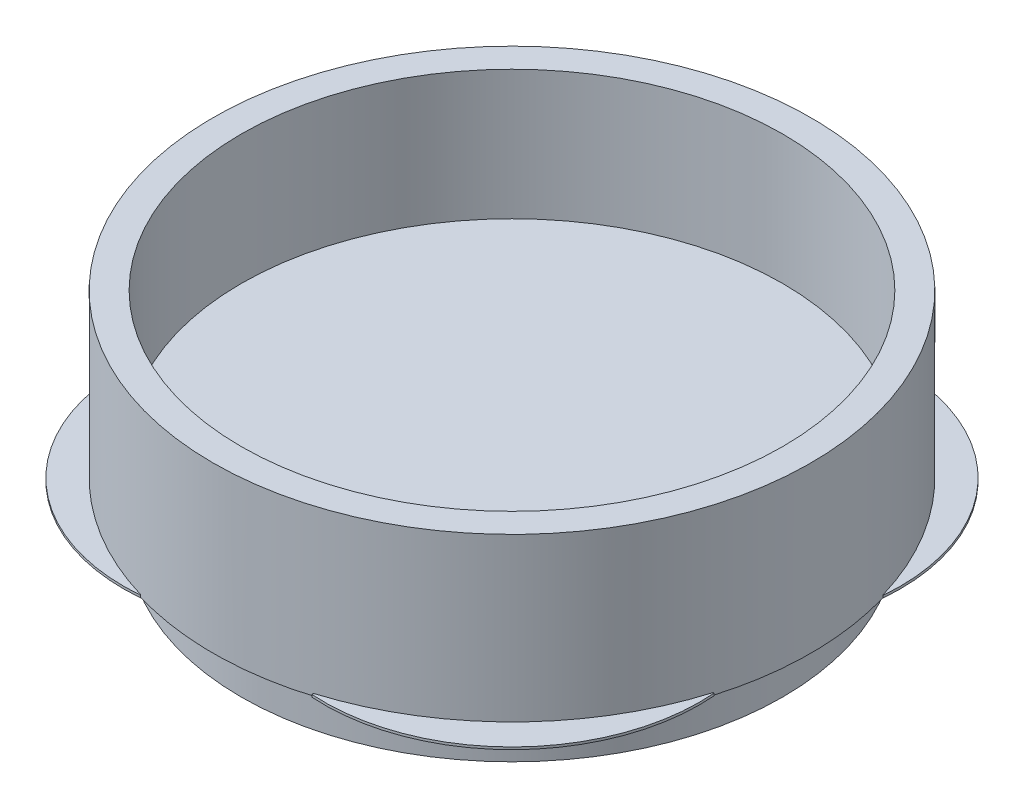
ISO-10303-21;
HEADER;
FILE_DESCRIPTION(('STEP AP214'),'2;1');
FILE_NAME('part.step','',(''),(''),'','','');
FILE_SCHEMA(('AUTOMOTIVE_DESIGN { 1 0 10303 214 1 1 1 1 }'));
ENDSEC;
DATA;
#1=APPLICATION_CONTEXT('core data for automotive mechanical design processes');
#2=APPLICATION_PROTOCOL_DEFINITION('international standard','automotive_design',2000,#1);
#3=PRODUCT_CONTEXT('',#1,'mechanical');
#4=PRODUCT('Part','Part','',(#3));
#5=PRODUCT_RELATED_PRODUCT_CATEGORY('part','',(#4));
#6=PRODUCT_DEFINITION_FORMATION('','',#4);
#7=PRODUCT_DEFINITION_CONTEXT('part definition',#1,'design');
#8=PRODUCT_DEFINITION('design','',#6,#7);
#9=PRODUCT_DEFINITION_SHAPE('','',#8);
#10=(LENGTH_UNIT() NAMED_UNIT(*) SI_UNIT(.MILLI.,.METRE.));
#11=(NAMED_UNIT(*) PLANE_ANGLE_UNIT() SI_UNIT($,.RADIAN.));
#12=(NAMED_UNIT(*) SI_UNIT($,.STERADIAN.) SOLID_ANGLE_UNIT());
#13=UNCERTAINTY_MEASURE_WITH_UNIT(LENGTH_MEASURE(1.E-05),#10,'distance_accuracy_value','');
#14=(GEOMETRIC_REPRESENTATION_CONTEXT(3) GLOBAL_UNCERTAINTY_ASSIGNED_CONTEXT((#13)) GLOBAL_UNIT_ASSIGNED_CONTEXT((#10,
#11,#12)) REPRESENTATION_CONTEXT('',''));
#15=CARTESIAN_POINT('',(0.,0.,0.));
#16=DIRECTION('',(0.,0.,1.));
#17=DIRECTION('',(1.,0.,0.));
#18=AXIS2_PLACEMENT_3D('',#15,#16,#17);
#19=CARTESIAN_POINT('',(0.,5.5,0.));
#20=DIRECTION('',(0.,-1.,0.));
#21=DIRECTION('',(0.,0.,-1.));
#22=AXIS2_PLACEMENT_3D('',#19,#20,#21);
#23=CYLINDRICAL_SURFACE('',#22,12.7);
#24=CARTESIAN_POINT('',(0.,5.5,0.));
#25=DIRECTION('',(0.,1.,0.));
#26=DIRECTION('',(0.,0.,1.));
#27=AXIS2_PLACEMENT_3D('',#24,#25,#26);
#28=CIRCLE('',#27,12.7);
#29=CARTESIAN_POINT('',(0.,5.5,12.7));
#30=VERTEX_POINT('',#29);
#31=EDGE_CURVE('E265',#30,#30,#28,.T.);
#32=ORIENTED_EDGE('',*,*,#31,.F.);
#33=EDGE_LOOP('',(#32));
#34=FACE_BOUND('',#33,.T.);
#35=DIRECTION('',(0.,-1.,0.));
#36=VECTOR('',#35,1.);
#37=CARTESIAN_POINT('',(3.71232288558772,-1.4,-12.1453142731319));
#38=LINE('',#37,#36);
#39=CARTESIAN_POINT('',(3.71232288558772,-1.4,-12.1453142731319));
#40=VERTEX_POINT('',#39);
#41=CARTESIAN_POINT('',(3.71232288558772,-1.5,-12.1453142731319));
#42=VERTEX_POINT('',#41);
#43=EDGE_CURVE('E282',#40,#42,#38,.T.);
#44=ORIENTED_EDGE('',*,*,#43,.T.);
#45=CARTESIAN_POINT('',(0.,-1.5,0.));
#46=DIRECTION('',(0.,-1.,0.));
#47=DIRECTION('',(0.,0.,-1.));
#48=AXIS2_PLACEMENT_3D('',#45,#46,#47);
#49=CIRCLE('',#48,12.7);
#50=CARTESIAN_POINT('',(-3.82733043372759,-1.5,-12.1095640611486));
#51=VERTEX_POINT('',#50);
#52=EDGE_CURVE('E166',#51,#42,#49,.T.);
#53=ORIENTED_EDGE('',*,*,#52,.F.);
#54=DIRECTION('',(0.,-1.,0.));
#55=VECTOR('',#54,1.);
#56=CARTESIAN_POINT('',(-3.82733043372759,-1.4,-12.1095640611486));
#57=LINE('',#56,#55);
#58=CARTESIAN_POINT('',(-3.82733043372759,-1.4,-12.1095640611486));
#59=VERTEX_POINT('',#58);
#60=EDGE_CURVE('E254',#59,#51,#57,.T.);
#61=ORIENTED_EDGE('',*,*,#60,.F.);
#62=CARTESIAN_POINT('',(0.,-1.4,0.));
#63=DIRECTION('',(0.,-1.,0.));
#64=DIRECTION('',(0.,0.,-1.));
#65=AXIS2_PLACEMENT_3D('',#62,#63,#64);
#66=CIRCLE('',#65,12.7);
#67=CARTESIAN_POINT('',(-12.1629347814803,-1.4,-3.65417808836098));
#68=VERTEX_POINT('',#67);
#69=EDGE_CURVE('E241',#68,#59,#66,.T.);
#70=ORIENTED_EDGE('',*,*,#69,.F.);
#71=DIRECTION('',(0.,-1.,0.));
#72=VECTOR('',#71,1.);
#73=CARTESIAN_POINT('',(-12.1629347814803,-1.4,-3.65417808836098));
#74=LINE('',#73,#72);
#75=CARTESIAN_POINT('',(-12.1629347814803,-1.5,-3.65417808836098));
#76=VERTEX_POINT('',#75);
#77=EDGE_CURVE('E250',#68,#76,#74,.T.);
#78=ORIENTED_EDGE('',*,*,#77,.T.);
#79=CARTESIAN_POINT('',(-12.1409745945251,-1.5,3.72649109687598));
#80=VERTEX_POINT('',#79);
#81=EDGE_CURVE('E262',#80,#76,#49,.T.);
#82=ORIENTED_EDGE('',*,*,#81,.F.);
#83=DIRECTION('',(0.,-1.,0.));
#84=VECTOR('',#83,1.);
#85=CARTESIAN_POINT('',(-12.1409745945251,-1.4,3.72649109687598));
#86=LINE('',#85,#84);
#87=CARTESIAN_POINT('',(-12.1409745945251,-1.4,3.72649109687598));
#88=VERTEX_POINT('',#87);
#89=EDGE_CURVE('E208',#88,#80,#86,.T.);
#90=ORIENTED_EDGE('',*,*,#89,.F.);
#91=CARTESIAN_POINT('',(0.,-1.4,0.));
#92=DIRECTION('',(0.,-1.,0.));
#93=DIRECTION('',(0.,0.,-1.));
#94=AXIS2_PLACEMENT_3D('',#91,#92,#93);
#95=CIRCLE('',#94,12.7);
#96=CARTESIAN_POINT('',(-3.58590990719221,-1.4,12.1832364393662));
#97=VERTEX_POINT('',#96);
#98=EDGE_CURVE('E205',#97,#88,#95,.T.);
#99=ORIENTED_EDGE('',*,*,#98,.F.);
#100=DIRECTION('',(0.,-1.,0.));
#101=VECTOR('',#100,1.);
#102=CARTESIAN_POINT('',(-3.58590990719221,-1.4,12.1832364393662));
#103=LINE('',#102,#101);
#104=CARTESIAN_POINT('',(-3.58590990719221,-1.5,12.1832364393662));
#105=VERTEX_POINT('',#104);
#106=EDGE_CURVE('E195',#97,#105,#103,.T.);
#107=ORIENTED_EDGE('',*,*,#106,.T.);
#108=CARTESIAN_POINT('',(3.71232288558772,-1.5,12.1453142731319));
#109=VERTEX_POINT('',#108);
#110=EDGE_CURVE('E295',#109,#105,#49,.T.);
#111=ORIENTED_EDGE('',*,*,#110,.F.);
#112=DIRECTION('',(0.,-1.,0.));
#113=VECTOR('',#112,1.);
#114=CARTESIAN_POINT('',(3.71232288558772,-1.4,12.1453142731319));
#115=LINE('',#114,#113);
#116=CARTESIAN_POINT('',(3.71232288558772,-1.4,12.1453142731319));
#117=VERTEX_POINT('',#116);
#118=EDGE_CURVE('E184',#117,#109,#115,.T.);
#119=ORIENTED_EDGE('',*,*,#118,.F.);
#120=CARTESIAN_POINT('',(0.,-1.4,0.));
#121=DIRECTION('',(0.,-1.,0.));
#122=DIRECTION('',(0.,0.,-1.));
#123=AXIS2_PLACEMENT_3D('',#120,#121,#122);
#124=CIRCLE('',#123,12.7);
#125=CARTESIAN_POINT('',(12.1705714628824,-1.4,3.62866232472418));
#126=VERTEX_POINT('',#125);
#127=EDGE_CURVE('E181',#126,#117,#124,.T.);
#128=ORIENTED_EDGE('',*,*,#127,.F.);
#129=DIRECTION('',(0.,-1.,0.));
#130=VECTOR('',#129,1.);
#131=CARTESIAN_POINT('',(12.1705714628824,-1.4,3.62866232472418));
#132=LINE('',#131,#130);
#133=CARTESIAN_POINT('',(12.1705714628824,-1.5,3.62866232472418));
#134=VERTEX_POINT('',#133);
#135=EDGE_CURVE('E167',#126,#134,#132,.T.);
#136=ORIENTED_EDGE('',*,*,#135,.T.);
#137=CARTESIAN_POINT('',(12.1907049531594,-1.5,-3.56043715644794));
#138=VERTEX_POINT('',#137);
#139=EDGE_CURVE('E268',#138,#134,#49,.T.);
#140=ORIENTED_EDGE('',*,*,#139,.F.);
#141=DIRECTION('',(0.,-1.,0.));
#142=VECTOR('',#141,1.);
#143=CARTESIAN_POINT('',(12.1907049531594,-1.4,-3.56043715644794));
#144=LINE('',#143,#142);
#145=CARTESIAN_POINT('',(12.1907049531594,-1.4,-3.56043715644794));
#146=VERTEX_POINT('',#145);
#147=EDGE_CURVE('E285',#146,#138,#144,.T.);
#148=ORIENTED_EDGE('',*,*,#147,.F.);
#149=CARTESIAN_POINT('',(0.,-1.4,0.));
#150=DIRECTION('',(0.,-1.,0.));
#151=DIRECTION('',(0.,0.,-1.));
#152=AXIS2_PLACEMENT_3D('',#149,#150,#151);
#153=CIRCLE('',#152,12.7);
#154=EDGE_CURVE('E11',#40,#146,#153,.T.);
#155=ORIENTED_EDGE('',*,*,#154,.F.);
#156=EDGE_LOOP('',(#44,#53,#61,#70,#78,#82,#90,#99,#107,#111,#119,#128,#136,#140,#148,#155));
#157=FACE_BOUND('',#156,.T.);
#158=ADVANCED_FACE('F37',(#34,#157),#23,.T.);
#159=CARTESIAN_POINT('',(0.,5.5,0.));
#160=DIRECTION('',(0.,1.,0.));
#161=DIRECTION('',(0.,0.,1.));
#162=AXIS2_PLACEMENT_3D('',#159,#160,#161);
#163=PLANE('',#162);
#164=ORIENTED_EDGE('',*,*,#31,.T.);
#165=EDGE_LOOP('',(#164));
#166=FACE_BOUND('',#165,.T.);
#167=CARTESIAN_POINT('',(0.,5.5,0.));
#168=DIRECTION('',(0.,1.,0.));
#169=DIRECTION('',(0.,0.,1.));
#170=AXIS2_PLACEMENT_3D('',#167,#168,#169);
#171=CIRCLE('',#170,11.5);
#172=CARTESIAN_POINT('',(0.,5.5,11.5));
#173=VERTEX_POINT('',#172);
#174=EDGE_CURVE('E269',#173,#173,#171,.T.);
#175=ORIENTED_EDGE('',*,*,#174,.F.);
#176=EDGE_LOOP('',(#175));
#177=FACE_BOUND('',#176,.T.);
#178=ADVANCED_FACE('F276',(#166,#177),#163,.T.);
#179=CARTESIAN_POINT('',(0.,5.5,0.));
#180=DIRECTION('',(0.,-1.,0.));
#181=DIRECTION('',(0.,0.,-1.));
#182=AXIS2_PLACEMENT_3D('',#179,#180,#181);
#183=CYLINDRICAL_SURFACE('',#182,11.5);
#184=ORIENTED_EDGE('',*,*,#174,.T.);
#185=EDGE_LOOP('',(#184));
#186=FACE_BOUND('',#185,.T.);
#187=CARTESIAN_POINT('',(0.,0.,0.));
#188=DIRECTION('',(0.,1.,0.));
#189=DIRECTION('',(0.,0.,1.));
#190=AXIS2_PLACEMENT_3D('',#187,#188,#189);
#191=CIRCLE('',#190,11.5);
#192=CARTESIAN_POINT('',(0.,0.,11.5));
#193=VERTEX_POINT('',#192);
#194=EDGE_CURVE('E267',#193,#193,#191,.T.);
#195=ORIENTED_EDGE('',*,*,#194,.F.);
#196=EDGE_LOOP('',(#195));
#197=FACE_BOUND('',#196,.T.);
#198=ADVANCED_FACE('F339',(#186,#197),#183,.F.);
#199=CARTESIAN_POINT('',(0.,-1.5,-28.0814213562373));
#200=DIRECTION('',(0.,-1.,0.));
#201=DIRECTION('',(0.,0.,-1.));
#202=AXIS2_PLACEMENT_3D('',#199,#200,#201);
#203=PLANE('',#202);
#204=CARTESIAN_POINT('',(0.,-1.5,0.));
#205=DIRECTION('',(0.,-1.,0.));
#206=DIRECTION('',(0.,0.,-1.));
#207=AXIS2_PLACEMENT_3D('',#204,#205,#206);
#208=CIRCLE('',#207,11.5);
#209=CARTESIAN_POINT('',(0.,-1.5,-11.5));
#210=VERTEX_POINT('',#209);
#211=EDGE_CURVE('E44',#210,#210,#208,.T.);
#212=ORIENTED_EDGE('',*,*,#211,.F.);
#213=EDGE_LOOP('',(#212));
#214=FACE_BOUND('',#213,.T.);
#215=ORIENTED_EDGE('',*,*,#52,.T.);
#216=DIRECTION('',(-0.963444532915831,0.,0.267907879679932));
#217=VECTOR('',#216,1.);
#218=CARTESIAN_POINT('',(4.01882150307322,-1.5,-12.2305432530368));
#219=LINE('',#218,#217);
#220=CARTESIAN_POINT('',(4.01882150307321,-1.5,-12.2305432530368));
#221=VERTEX_POINT('',#220);
#222=EDGE_CURVE('E152',#221,#42,#219,.T.);
#223=ORIENTED_EDGE('',*,*,#222,.F.);
#224=CARTESIAN_POINT('',(4.2625,-1.5,-4.262));
#225=DIRECTION('',(0.,-1.,0.));
#226=DIRECTION('',(0.,0.,-1.));
#227=AXIS2_PLACEMENT_3D('',#224,#225,#226);
#228=CIRCLE('',#227,7.97226823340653);
#229=CARTESIAN_POINT('',(12.2036688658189,-1.5,-3.55851024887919));
#230=VERTEX_POINT('',#229);
#231=EDGE_CURVE('E164',#221,#230,#228,.T.);
#232=ORIENTED_EDGE('',*,*,#231,.T.);
#233=DIRECTION('',(-0.989133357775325,0.,-0.147021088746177));
#234=VECTOR('',#233,1.);
#235=CARTESIAN_POINT('',(12.2036688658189,-1.5,-3.55851024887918));
#236=LINE('',#235,#234);
#237=EDGE_CURVE('E51',#230,#138,#236,.T.);
#238=ORIENTED_EDGE('',*,*,#237,.T.);
#239=ORIENTED_EDGE('',*,*,#139,.T.);
#240=DIRECTION('',(-0.99271686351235,0.,0.120470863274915));
#241=VECTOR('',#240,1.);
#242=CARTESIAN_POINT('',(3.9689528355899,-1.5,4.62396734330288));
#243=LINE('',#242,#241);
#244=CARTESIAN_POINT('',(12.2091964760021,-1.5,3.62397499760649));
#245=VERTEX_POINT('',#244);
#246=EDGE_CURVE('E192',#245,#134,#243,.T.);
#247=ORIENTED_EDGE('',*,*,#246,.F.);
#248=CARTESIAN_POINT('',(4.2625,-1.5,4.262));
#249=DIRECTION('',(0.,-1.,0.));
#250=DIRECTION('',(0.,0.,-1.));
#251=AXIS2_PLACEMENT_3D('',#248,#249,#250);
#252=CIRCLE('',#251,7.97226823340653);
#253=CARTESIAN_POINT('',(3.71232288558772,-1.5,12.2152613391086));
#254=VERTEX_POINT('',#253);
#255=EDGE_CURVE('E189',#245,#254,#252,.T.);
#256=ORIENTED_EDGE('',*,*,#255,.T.);
#257=DIRECTION('',(0.,0.,1.));
#258=VECTOR('',#257,1.);
#259=CARTESIAN_POINT('',(3.71232288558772,-1.5,-28.0814213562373));
#260=LINE('',#259,#258);
#261=EDGE_CURVE('E58',#109,#254,#260,.T.);
#262=ORIENTED_EDGE('',*,*,#261,.F.);
#263=ORIENTED_EDGE('',*,*,#110,.T.);
#264=DIRECTION('',(0.374010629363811,0.,0.927424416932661));
#265=VECTOR('',#264,1.);
#266=CARTESIAN_POINT('',(-17.0507632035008,-1.5,-21.2052096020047));
#267=LINE('',#266,#265);
#268=CARTESIAN_POINT('',(-3.57722919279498,-1.5,12.2047617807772));
#269=VERTEX_POINT('',#268);
#270=EDGE_CURVE('E220',#105,#269,#267,.T.);
#271=ORIENTED_EDGE('',*,*,#270,.T.);
#272=CARTESIAN_POINT('',(-4.2625,-1.5,4.262));
#273=DIRECTION('',(0.,-1.,0.));
#274=DIRECTION('',(0.,0.,-1.));
#275=AXIS2_PLACEMENT_3D('',#272,#273,#274);
#276=CIRCLE('',#275,7.97226823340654);
#277=CARTESIAN_POINT('',(-12.2141550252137,-1.5,3.68907492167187));
#278=VERTEX_POINT('',#277);
#279=EDGE_CURVE('E216',#269,#278,#276,.T.);
#280=ORIENTED_EDGE('',*,*,#279,.T.);
#281=DIRECTION('',(-0.890371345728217,0.,-0.455234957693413));
#282=VECTOR('',#281,1.);
#283=CARTESIAN_POINT('',(-15.4087245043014,-1.5,2.05573428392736));
#284=LINE('',#283,#282);
#285=EDGE_CURVE('E213',#80,#278,#284,.T.);
#286=ORIENTED_EDGE('',*,*,#285,.F.);
#287=ORIENTED_EDGE('',*,*,#81,.T.);
#288=DIRECTION('',(0.960539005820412,0.,0.278145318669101));
#289=VECTOR('',#288,1.);
#290=CARTESIAN_POINT('',(-7.46719584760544,-1.5,-2.29442299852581));
#291=LINE('',#290,#289);
#292=CARTESIAN_POINT('',(-12.2126513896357,-1.5,-3.66857463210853));
#293=VERTEX_POINT('',#292);
#294=EDGE_CURVE('E223',#293,#76,#291,.T.);
#295=ORIENTED_EDGE('',*,*,#294,.F.);
#296=CARTESIAN_POINT('',(-4.2625,-1.5,-4.262));
#297=DIRECTION('',(0.,-1.,0.));
#298=DIRECTION('',(0.,0.,-1.));
#299=AXIS2_PLACEMENT_3D('',#296,#297,#298);
#300=CIRCLE('',#299,7.97226823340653);
#301=CARTESIAN_POINT('',(-4.00434757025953,-1.5,-12.2300874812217));
#302=VERTEX_POINT('',#301);
#303=EDGE_CURVE('E246',#293,#302,#300,.T.);
#304=ORIENTED_EDGE('',*,*,#303,.T.);
#305=DIRECTION('',(0.826596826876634,0.,0.562794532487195));
#306=VECTOR('',#305,1.);
#307=CARTESIAN_POINT('',(-8.64243447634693,-1.5,-15.3879630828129));
#308=LINE('',#307,#306);
#309=EDGE_CURVE('E235',#302,#51,#308,.T.);
#310=ORIENTED_EDGE('',*,*,#309,.T.);
#311=EDGE_LOOP('',(#215,#223,#232,#238,#239,#247,#256,#262,#263,#271,#280,#286,#287,#295,#304,#310));
#312=FACE_BOUND('',#311,.T.);
#313=ADVANCED_FACE('F163',(#214,#312),#203,.T.);
#314=CARTESIAN_POINT('',(0.,0.,-28.0814213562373));
#315=DIRECTION('',(0.,-1.,0.));
#316=DIRECTION('',(0.,0.,-1.));
#317=AXIS2_PLACEMENT_3D('',#314,#315,#316);
#318=PLANE('',#317);
#319=ORIENTED_EDGE('',*,*,#194,.T.);
#320=EDGE_LOOP('',(#319));
#321=FACE_BOUND('',#320,.T.);
#322=ADVANCED_FACE('F332',(#321),#318,.F.);
#323=CARTESIAN_POINT('',(-28.0814213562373,-3.71488259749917,0.));
#324=DIRECTION('',(0.,1.,0.));
#325=DIRECTION('',(0.,0.,1.));
#326=AXIS2_PLACEMENT_3D('',#323,#324,#325);
#327=PLANE('',#326);
#328=CARTESIAN_POINT('',(0.,-3.71488259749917,0.));
#329=DIRECTION('',(0.,1.,0.));
#330=DIRECTION('',(0.,0.,1.));
#331=AXIS2_PLACEMENT_3D('',#328,#329,#330);
#332=CIRCLE('',#331,11.5);
#333=CARTESIAN_POINT('',(0.,-3.71488259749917,11.5));
#334=VERTEX_POINT('',#333);
#335=EDGE_CURVE('E253',#334,#334,#332,.T.);
#336=ORIENTED_EDGE('',*,*,#335,.F.);
#337=EDGE_LOOP('',(#336));
#338=FACE_BOUND('',#337,.T.);
#339=ADVANCED_FACE('F329',(#338),#327,.F.);
#340=CARTESIAN_POINT('',(0.,-3.71488259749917,0.));
#341=DIRECTION('',(0.,1.,0.));
#342=DIRECTION('',(0.,0.,1.));
#343=AXIS2_PLACEMENT_3D('',#340,#341,#342);
#344=CYLINDRICAL_SURFACE('',#343,11.5);
#345=ORIENTED_EDGE('',*,*,#211,.T.);
#346=EDGE_LOOP('',(#345));
#347=FACE_BOUND('',#346,.T.);
#348=ORIENTED_EDGE('',*,*,#335,.T.);
#349=EDGE_LOOP('',(#348));
#350=FACE_BOUND('',#349,.T.);
#351=ADVANCED_FACE('F328',(#347,#350),#344,.T.);
#352=CARTESIAN_POINT('',(-7.46719584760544,-1.4,-2.29442299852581));
#353=DIRECTION('',(0.278145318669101,0.,-0.960539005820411));
#354=DIRECTION('',(-0.960539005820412,0.,-0.278145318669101));
#355=AXIS2_PLACEMENT_3D('',#352,#353,#354);
#356=PLANE('',#355);
#357=ORIENTED_EDGE('',*,*,#294,.T.);
#358=ORIENTED_EDGE('',*,*,#77,.F.);
#359=DIRECTION('',(0.960539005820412,0.,0.278145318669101));
#360=VECTOR('',#359,1.);
#361=CARTESIAN_POINT('',(-7.46719584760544,-1.4,-2.29442299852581));
#362=LINE('',#361,#360);
#363=CARTESIAN_POINT('',(-12.2126513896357,-1.4,-3.66857463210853));
#364=VERTEX_POINT('',#363);
#365=EDGE_CURVE('E232',#364,#68,#362,.T.);
#366=ORIENTED_EDGE('',*,*,#365,.F.);
#367=DIRECTION('',(0.,-1.,0.));
#368=VECTOR('',#367,1.);
#369=CARTESIAN_POINT('',(-12.2126513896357,-1.4,-3.66857463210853));
#370=LINE('',#369,#368);
#371=EDGE_CURVE('E243',#364,#293,#370,.T.);
#372=ORIENTED_EDGE('',*,*,#371,.T.);
#373=EDGE_LOOP('',(#357,#358,#366,#372));
#374=FACE_BOUND('',#373,.T.);
#375=ADVANCED_FACE('F304',(#374),#356,.F.);
#376=CARTESIAN_POINT('',(-8.64243447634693,-1.4,-15.3879630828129));
#377=DIRECTION('',(0.562794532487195,0.,-0.826596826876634));
#378=DIRECTION('',(-0.826596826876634,0.,-0.562794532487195));
#379=AXIS2_PLACEMENT_3D('',#376,#377,#378);
#380=PLANE('',#379);
#381=ORIENTED_EDGE('',*,*,#309,.F.);
#382=DIRECTION('',(0.,-1.,0.));
#383=VECTOR('',#382,1.);
#384=CARTESIAN_POINT('',(-4.00434757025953,-1.4,-12.2300874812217));
#385=LINE('',#384,#383);
#386=CARTESIAN_POINT('',(-4.00434757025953,-1.4,-12.2300874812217));
#387=VERTEX_POINT('',#386);
#388=EDGE_CURVE('E257',#387,#302,#385,.T.);
#389=ORIENTED_EDGE('',*,*,#388,.F.);
#390=DIRECTION('',(0.826596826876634,0.,0.562794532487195));
#391=VECTOR('',#390,1.);
#392=CARTESIAN_POINT('',(-8.64243447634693,-1.4,-15.3879630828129));
#393=LINE('',#392,#391);
#394=EDGE_CURVE('E238',#387,#59,#393,.T.);
#395=ORIENTED_EDGE('',*,*,#394,.T.);
#396=ORIENTED_EDGE('',*,*,#60,.T.);
#397=EDGE_LOOP('',(#381,#389,#395,#396));
#398=FACE_BOUND('',#397,.T.);
#399=ADVANCED_FACE('F313',(#398),#380,.T.);
#400=CARTESIAN_POINT('',(-4.2625,-1.4,-4.262));
#401=DIRECTION('',(0.,-1.,0.));
#402=DIRECTION('',(0.,0.,-1.));
#403=AXIS2_PLACEMENT_3D('',#400,#401,#402);
#404=CYLINDRICAL_SURFACE('',#403,7.97226823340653);
#405=ORIENTED_EDGE('',*,*,#303,.F.);
#406=ORIENTED_EDGE('',*,*,#371,.F.);
#407=CARTESIAN_POINT('',(-4.2625,-1.4,-4.262));
#408=DIRECTION('',(0.,-1.,0.));
#409=DIRECTION('',(0.,0.,-1.));
#410=AXIS2_PLACEMENT_3D('',#407,#408,#409);
#411=CIRCLE('',#410,7.97226823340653);
#412=EDGE_CURVE('E234',#364,#387,#411,.T.);
#413=ORIENTED_EDGE('',*,*,#412,.T.);
#414=ORIENTED_EDGE('',*,*,#388,.T.);
#415=EDGE_LOOP('',(#405,#406,#413,#414));
#416=FACE_BOUND('',#415,.T.);
#417=ADVANCED_FACE('F315',(#416),#404,.T.);
#418=CARTESIAN_POINT('',(0.,-1.4,-28.0814213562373));
#419=DIRECTION('',(0.,-1.,0.));
#420=DIRECTION('',(0.,0.,-1.));
#421=AXIS2_PLACEMENT_3D('',#418,#419,#420);
#422=PLANE('',#421);
#423=ORIENTED_EDGE('',*,*,#365,.T.);
#424=ORIENTED_EDGE('',*,*,#69,.T.);
#425=ORIENTED_EDGE('',*,*,#394,.F.);
#426=ORIENTED_EDGE('',*,*,#412,.F.);
#427=EDGE_LOOP('',(#423,#424,#425,#426));
#428=FACE_BOUND('',#427,.T.);
#429=ADVANCED_FACE('F309',(#428),#422,.F.);
#430=CARTESIAN_POINT('',(-17.0507632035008,-1.4,-21.2052096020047));
#431=DIRECTION('',(0.927424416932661,0.,-0.374010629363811));
#432=DIRECTION('',(-0.374010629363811,0.,-0.927424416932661));
#433=AXIS2_PLACEMENT_3D('',#430,#431,#432);
#434=PLANE('',#433);
#435=ORIENTED_EDGE('',*,*,#270,.F.);
#436=ORIENTED_EDGE('',*,*,#106,.F.);
#437=DIRECTION('',(0.374010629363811,0.,0.927424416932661));
#438=VECTOR('',#437,1.);
#439=CARTESIAN_POINT('',(-17.0507632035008,-1.4,-21.2052096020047));
#440=LINE('',#439,#438);
#441=CARTESIAN_POINT('',(-3.57722919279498,-1.4,12.2047617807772));
#442=VERTEX_POINT('',#441);
#443=EDGE_CURVE('E217',#97,#442,#440,.T.);
#444=ORIENTED_EDGE('',*,*,#443,.T.);
#445=DIRECTION('',(0.,-1.,0.));
#446=VECTOR('',#445,1.);
#447=CARTESIAN_POINT('',(-3.57722919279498,-1.4,12.2047617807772));
#448=LINE('',#447,#446);
#449=EDGE_CURVE('E203',#442,#269,#448,.T.);
#450=ORIENTED_EDGE('',*,*,#449,.T.);
#451=EDGE_LOOP('',(#435,#436,#444,#450));
#452=FACE_BOUND('',#451,.T.);
#453=ADVANCED_FACE('F322',(#452),#434,.T.);
#454=CARTESIAN_POINT('',(-15.4087245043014,-1.4,2.05573428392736));
#455=DIRECTION('',(-0.455234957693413,0.,0.890371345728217));
#456=DIRECTION('',(0.890371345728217,0.,0.455234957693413));
#457=AXIS2_PLACEMENT_3D('',#454,#455,#456);
#458=PLANE('',#457);
#459=ORIENTED_EDGE('',*,*,#285,.T.);
#460=DIRECTION('',(0.,-1.,0.));
#461=VECTOR('',#460,1.);
#462=CARTESIAN_POINT('',(-12.2141550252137,-1.4,3.68907492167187));
#463=LINE('',#462,#461);
#464=CARTESIAN_POINT('',(-12.2141550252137,-1.4,3.68907492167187));
#465=VERTEX_POINT('',#464);
#466=EDGE_CURVE('E206',#465,#278,#463,.T.);
#467=ORIENTED_EDGE('',*,*,#466,.F.);
#468=DIRECTION('',(-0.890371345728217,0.,-0.455234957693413));
#469=VECTOR('',#468,1.);
#470=CARTESIAN_POINT('',(-15.4087245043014,-1.4,2.05573428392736));
#471=LINE('',#470,#469);
#472=EDGE_CURVE('E225',#88,#465,#471,.T.);
#473=ORIENTED_EDGE('',*,*,#472,.F.);
#474=ORIENTED_EDGE('',*,*,#89,.T.);
#475=EDGE_LOOP('',(#459,#467,#473,#474));
#476=FACE_BOUND('',#475,.T.);
#477=ADVANCED_FACE('F402',(#476),#458,.F.);
#478=CARTESIAN_POINT('',(-4.2625,-1.4,4.262));
#479=DIRECTION('',(0.,-1.,0.));
#480=DIRECTION('',(0.,0.,-1.));
#481=AXIS2_PLACEMENT_3D('',#478,#479,#480);
#482=CYLINDRICAL_SURFACE('',#481,7.97226823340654);
#483=ORIENTED_EDGE('',*,*,#279,.F.);
#484=ORIENTED_EDGE('',*,*,#449,.F.);
#485=CARTESIAN_POINT('',(-4.2625,-1.4,4.262));
#486=DIRECTION('',(0.,-1.,0.));
#487=DIRECTION('',(0.,0.,-1.));
#488=AXIS2_PLACEMENT_3D('',#485,#486,#487);
#489=CIRCLE('',#488,7.97226823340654);
#490=EDGE_CURVE('E227',#442,#465,#489,.T.);
#491=ORIENTED_EDGE('',*,*,#490,.T.);
#492=ORIENTED_EDGE('',*,*,#466,.T.);
#493=EDGE_LOOP('',(#483,#484,#491,#492));
#494=FACE_BOUND('',#493,.T.);
#495=ADVANCED_FACE('F412',(#494),#482,.T.);
#496=CARTESIAN_POINT('',(0.,-1.4,-28.0814213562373));
#497=DIRECTION('',(0.,-1.,0.));
#498=DIRECTION('',(0.,0.,-1.));
#499=AXIS2_PLACEMENT_3D('',#496,#497,#498);
#500=PLANE('',#499);
#501=ORIENTED_EDGE('',*,*,#443,.F.);
#502=ORIENTED_EDGE('',*,*,#98,.T.);
#503=ORIENTED_EDGE('',*,*,#472,.T.);
#504=ORIENTED_EDGE('',*,*,#490,.F.);
#505=EDGE_LOOP('',(#501,#502,#503,#504));
#506=FACE_BOUND('',#505,.T.);
#507=ADVANCED_FACE('F422',(#506),#500,.F.);
#508=CARTESIAN_POINT('',(3.9689528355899,-1.4,4.62396734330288));
#509=DIRECTION('',(0.120470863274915,0.,0.99271686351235));
#510=DIRECTION('',(0.99271686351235,0.,-0.120470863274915));
#511=AXIS2_PLACEMENT_3D('',#508,#509,#510);
#512=PLANE('',#511);
#513=ORIENTED_EDGE('',*,*,#246,.T.);
#514=ORIENTED_EDGE('',*,*,#135,.F.);
#515=DIRECTION('',(-0.99271686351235,0.,0.120470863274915));
#516=VECTOR('',#515,1.);
#517=CARTESIAN_POINT('',(3.9689528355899,-1.4,4.62396734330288));
#518=LINE('',#517,#516);
#519=CARTESIAN_POINT('',(12.2091964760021,-1.4,3.62397499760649));
#520=VERTEX_POINT('',#519);
#521=EDGE_CURVE('E190',#520,#126,#518,.T.);
#522=ORIENTED_EDGE('',*,*,#521,.F.);
#523=DIRECTION('',(0.,-1.,0.));
#524=VECTOR('',#523,1.);
#525=CARTESIAN_POINT('',(12.2091964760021,-1.4,3.62397499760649));
#526=LINE('',#525,#524);
#527=EDGE_CURVE('E179',#520,#245,#526,.T.);
#528=ORIENTED_EDGE('',*,*,#527,.T.);
#529=EDGE_LOOP('',(#513,#514,#522,#528));
#530=FACE_BOUND('',#529,.T.);
#531=ADVANCED_FACE('F432',(#530),#512,.F.);
#532=CARTESIAN_POINT('',(3.71232288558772,-1.4,-28.0814213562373));
#533=DIRECTION('',(1.,0.,0.));
#534=DIRECTION('',(0.,0.,-1.));
#535=AXIS2_PLACEMENT_3D('',#532,#533,#534);
#536=PLANE('',#535);
#537=ORIENTED_EDGE('',*,*,#261,.T.);
#538=DIRECTION('',(0.,-1.,0.));
#539=VECTOR('',#538,1.);
#540=CARTESIAN_POINT('',(3.71232288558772,-1.4,12.2152613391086));
#541=LINE('',#540,#539);
#542=CARTESIAN_POINT('',(3.71232288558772,-1.4,12.2152613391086));
#543=VERTEX_POINT('',#542);
#544=EDGE_CURVE('E182',#543,#254,#541,.T.);
#545=ORIENTED_EDGE('',*,*,#544,.F.);
#546=DIRECTION('',(0.,0.,1.));
#547=VECTOR('',#546,1.);
#548=CARTESIAN_POINT('',(3.71232288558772,-1.4,-28.0814213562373));
#549=LINE('',#548,#547);
#550=EDGE_CURVE('E197',#117,#543,#549,.T.);
#551=ORIENTED_EDGE('',*,*,#550,.F.);
#552=ORIENTED_EDGE('',*,*,#118,.T.);
#553=EDGE_LOOP('',(#537,#545,#551,#552));
#554=FACE_BOUND('',#553,.T.);
#555=ADVANCED_FACE('F442',(#554),#536,.F.);
#556=CARTESIAN_POINT('',(4.2625,-1.4,4.262));
#557=DIRECTION('',(0.,-1.,0.));
#558=DIRECTION('',(0.,0.,-1.));
#559=AXIS2_PLACEMENT_3D('',#556,#557,#558);
#560=CYLINDRICAL_SURFACE('',#559,7.97226823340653);
#561=ORIENTED_EDGE('',*,*,#255,.F.);
#562=ORIENTED_EDGE('',*,*,#527,.F.);
#563=CARTESIAN_POINT('',(4.2625,-1.4,4.262));
#564=DIRECTION('',(0.,-1.,0.));
#565=DIRECTION('',(0.,0.,-1.));
#566=AXIS2_PLACEMENT_3D('',#563,#564,#565);
#567=CIRCLE('',#566,7.97226823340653);
#568=EDGE_CURVE('E199',#520,#543,#567,.T.);
#569=ORIENTED_EDGE('',*,*,#568,.T.);
#570=ORIENTED_EDGE('',*,*,#544,.T.);
#571=EDGE_LOOP('',(#561,#562,#569,#570));
#572=FACE_BOUND('',#571,.T.);
#573=ADVANCED_FACE('F452',(#572),#560,.T.);
#574=CARTESIAN_POINT('',(0.,-1.4,-28.0814213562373));
#575=DIRECTION('',(0.,-1.,0.));
#576=DIRECTION('',(0.,0.,-1.));
#577=AXIS2_PLACEMENT_3D('',#574,#575,#576);
#578=PLANE('',#577);
#579=ORIENTED_EDGE('',*,*,#521,.T.);
#580=ORIENTED_EDGE('',*,*,#127,.T.);
#581=ORIENTED_EDGE('',*,*,#550,.T.);
#582=ORIENTED_EDGE('',*,*,#568,.F.);
#583=EDGE_LOOP('',(#579,#580,#581,#582));
#584=FACE_BOUND('',#583,.T.);
#585=ADVANCED_FACE('F462',(#584),#578,.F.);
#586=CARTESIAN_POINT('',(0.,-1.4,0.));
#587=DIRECTION('',(0.,-1.,0.));
#588=DIRECTION('',(0.,0.,-1.));
#589=AXIS2_PLACEMENT_3D('',#586,#587,#588);
#590=PLANE('',#589);
#591=DIRECTION('',(-0.963444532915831,0.,0.267907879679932));
#592=VECTOR('',#591,1.);
#593=CARTESIAN_POINT('',(4.01882150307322,-1.4,-12.2305432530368));
#594=LINE('',#593,#592);
#595=CARTESIAN_POINT('',(4.01882150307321,-1.4,-12.2305432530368));
#596=VERTEX_POINT('',#595);
#597=EDGE_CURVE('E154',#596,#40,#594,.T.);
#598=ORIENTED_EDGE('',*,*,#597,.T.);
#599=ORIENTED_EDGE('',*,*,#154,.T.);
#600=DIRECTION('',(-0.989133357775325,0.,-0.147021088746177));
#601=VECTOR('',#600,1.);
#602=CARTESIAN_POINT('',(12.2036688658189,-1.4,-3.55851024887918));
#603=LINE('',#602,#601);
#604=CARTESIAN_POINT('',(12.2036688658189,-1.4,-3.55851024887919));
#605=VERTEX_POINT('',#604);
#606=EDGE_CURVE('E172',#605,#146,#603,.T.);
#607=ORIENTED_EDGE('',*,*,#606,.F.);
#608=CARTESIAN_POINT('',(4.2625,-1.4,-4.262));
#609=DIRECTION('',(0.,-1.,0.));
#610=DIRECTION('',(0.,0.,-1.));
#611=AXIS2_PLACEMENT_3D('',#608,#609,#610);
#612=CIRCLE('',#611,7.97226823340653);
#613=EDGE_CURVE('E159',#596,#605,#612,.T.);
#614=ORIENTED_EDGE('',*,*,#613,.F.);
#615=EDGE_LOOP('',(#598,#599,#607,#614));
#616=FACE_BOUND('',#615,.T.);
#617=ADVANCED_FACE('F472',(#616),#590,.F.);
#618=CARTESIAN_POINT('',(4.01882150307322,-1.4,-12.2305432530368));
#619=DIRECTION('',(0.267907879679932,0.,0.963444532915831));
#620=DIRECTION('',(0.963444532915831,0.,-0.267907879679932));
#621=AXIS2_PLACEMENT_3D('',#618,#619,#620);
#622=PLANE('',#621);
#623=ORIENTED_EDGE('',*,*,#222,.T.);
#624=ORIENTED_EDGE('',*,*,#43,.F.);
#625=ORIENTED_EDGE('',*,*,#597,.F.);
#626=DIRECTION('',(0.,-1.,0.));
#627=VECTOR('',#626,1.);
#628=CARTESIAN_POINT('',(4.01882150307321,-1.4,-12.2305432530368));
#629=LINE('',#628,#627);
#630=EDGE_CURVE('E148',#596,#221,#629,.T.);
#631=ORIENTED_EDGE('',*,*,#630,.T.);
#632=EDGE_LOOP('',(#623,#624,#625,#631));
#633=FACE_BOUND('',#632,.T.);
#634=ADVANCED_FACE('F150',(#633),#622,.F.);
#635=CARTESIAN_POINT('',(12.2036688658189,-1.4,-3.55851024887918));
#636=DIRECTION('',(-0.147021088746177,0.,0.989133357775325));
#637=DIRECTION('',(0.989133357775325,0.,0.147021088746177));
#638=AXIS2_PLACEMENT_3D('',#635,#636,#637);
#639=PLANE('',#638);
#640=ORIENTED_EDGE('',*,*,#237,.F.);
#641=DIRECTION('',(0.,-1.,0.));
#642=VECTOR('',#641,1.);
#643=CARTESIAN_POINT('',(12.2036688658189,-1.4,-3.55851024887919));
#644=LINE('',#643,#642);
#645=EDGE_CURVE('E160',#605,#230,#644,.T.);
#646=ORIENTED_EDGE('',*,*,#645,.F.);
#647=ORIENTED_EDGE('',*,*,#606,.T.);
#648=ORIENTED_EDGE('',*,*,#147,.T.);
#649=EDGE_LOOP('',(#640,#646,#647,#648));
#650=FACE_BOUND('',#649,.T.);
#651=ADVANCED_FACE('F290',(#650),#639,.T.);
#652=CARTESIAN_POINT('',(4.2625,-1.4,-4.262));
#653=DIRECTION('',(0.,-1.,0.));
#654=DIRECTION('',(0.,0.,-1.));
#655=AXIS2_PLACEMENT_3D('',#652,#653,#654);
#656=CYLINDRICAL_SURFACE('',#655,7.97226823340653);
#657=ORIENTED_EDGE('',*,*,#231,.F.);
#658=ORIENTED_EDGE('',*,*,#630,.F.);
#659=ORIENTED_EDGE('',*,*,#613,.T.);
#660=ORIENTED_EDGE('',*,*,#645,.T.);
#661=EDGE_LOOP('',(#657,#658,#659,#660));
#662=FACE_BOUND('',#661,.T.);
#663=ADVANCED_FACE('F169',(#662),#656,.T.);
#664=CLOSED_SHELL('',(#158,#178,#198,#313,#322,#339,#351,#375,#399,#417,#429,#453,#477,#495,
#507,#531,#555,#573,#585,#617,#634,#651,#663));
#665=MANIFOLD_SOLID_BREP('B2',#664);
#666=ADVANCED_BREP_SHAPE_REPRESENTATION('',(#18,#665),#14);
#667=SHAPE_DEFINITION_REPRESENTATION(#9,#666);
ENDSEC;
END-ISO-10303-21;
